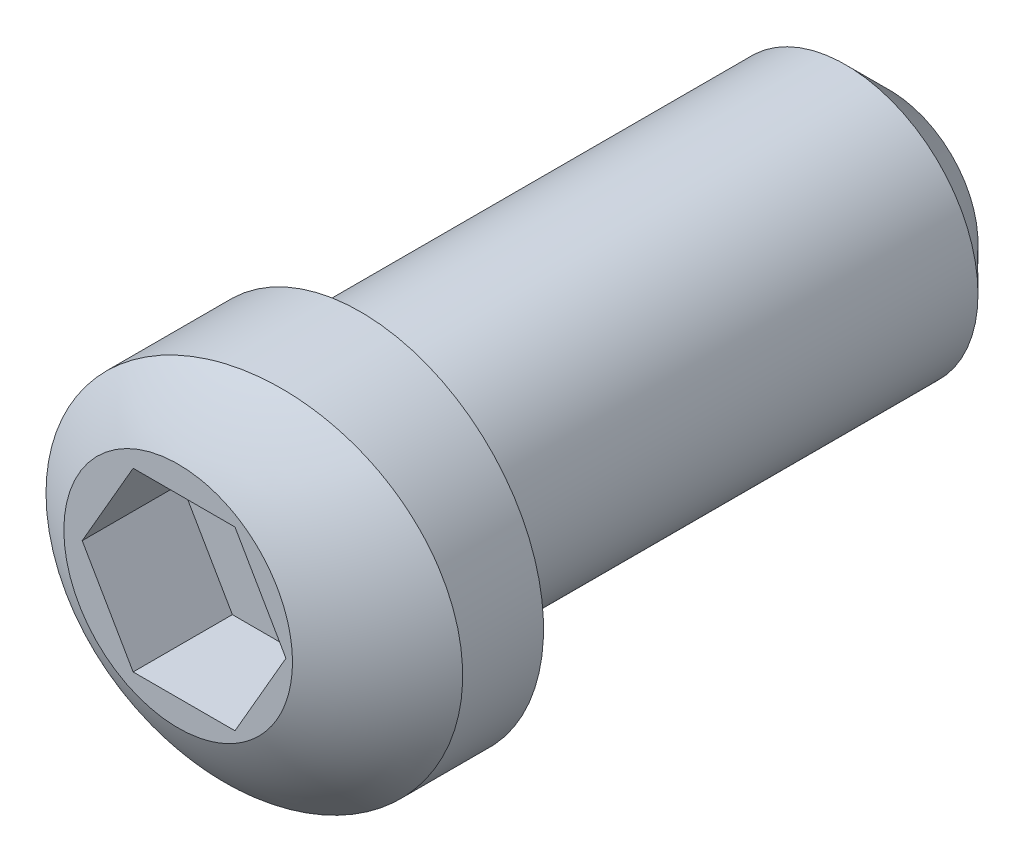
ISO-10303-21;
HEADER;
FILE_DESCRIPTION(('STEP AP214'),'2;1');
FILE_NAME('part.step','',(''),(''),'','','');
FILE_SCHEMA(('AUTOMOTIVE_DESIGN { 1 0 10303 214 1 1 1 1 }'));
ENDSEC;
DATA;
#1=APPLICATION_CONTEXT('core data for automotive mechanical design processes');
#2=APPLICATION_PROTOCOL_DEFINITION('international standard','automotive_design',2000,#1);
#3=PRODUCT_CONTEXT('',#1,'mechanical');
#4=PRODUCT('Part','Part','',(#3));
#5=PRODUCT_RELATED_PRODUCT_CATEGORY('part','',(#4));
#6=PRODUCT_DEFINITION_FORMATION('','',#4);
#7=PRODUCT_DEFINITION_CONTEXT('part definition',#1,'design');
#8=PRODUCT_DEFINITION('design','',#6,#7);
#9=PRODUCT_DEFINITION_SHAPE('','',#8);
#10=(LENGTH_UNIT() NAMED_UNIT(*) SI_UNIT(.MILLI.,.METRE.));
#11=(NAMED_UNIT(*) PLANE_ANGLE_UNIT() SI_UNIT($,.RADIAN.));
#12=(NAMED_UNIT(*) SI_UNIT($,.STERADIAN.) SOLID_ANGLE_UNIT());
#13=UNCERTAINTY_MEASURE_WITH_UNIT(LENGTH_MEASURE(1.E-05),#10,'distance_accuracy_value','');
#14=(GEOMETRIC_REPRESENTATION_CONTEXT(3) GLOBAL_UNCERTAINTY_ASSIGNED_CONTEXT((#13)) GLOBAL_UNIT_ASSIGNED_CONTEXT((#10,
#11,#12)) REPRESENTATION_CONTEXT('',''));
#15=CARTESIAN_POINT('',(0.,0.,0.));
#16=DIRECTION('',(0.,0.,1.));
#17=DIRECTION('',(1.,0.,0.));
#18=AXIS2_PLACEMENT_3D('',#15,#16,#17);
#19=CARTESIAN_POINT('',(9.9709752,8.97097519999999,4.11212093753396E-09));
#20=DIRECTION('',(-2.84865179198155E-10,-1.417613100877E-10,1.));
#21=DIRECTION('',(-1.,0.,-2.84865179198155E-10));
#22=AXIS2_PLACEMENT_3D('',#19,#20,#21);
#23=PLANE('',#22);
#24=CARTESIAN_POINT('',(0.,0.,0.));
#25=DIRECTION('',(-2.84865179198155E-10,-1.417613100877E-10,1.));
#26=DIRECTION('',(1.,0.,2.84865179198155E-10));
#27=AXIS2_PLACEMENT_3D('',#24,#25,#26);
#28=CIRCLE('',#27,6.);
#29=CARTESIAN_POINT('',(6.,0.,1.70919164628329E-09));
#30=VERTEX_POINT('',#29);
#31=EDGE_CURVE('E127',#30,#30,#28,.F.);
#32=ORIENTED_EDGE('',*,*,#31,.F.);
#33=EDGE_LOOP('',(#32));
#34=FACE_BOUND('',#33,.T.);
#35=CARTESIAN_POINT('',(1.,0.,2.84865179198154E-10));
#36=DIRECTION('',(2.84865179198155E-10,1.417613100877E-10,-1.));
#37=DIRECTION('',(-1.,0.,-2.84865179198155E-10));
#38=AXIS2_PLACEMENT_3D('',#35,#36,#37);
#39=CIRCLE('',#38,8.3);
#40=CARTESIAN_POINT('',(-7.3,0.,-2.07951580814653E-09));
#41=VERTEX_POINT('',#40);
#42=EDGE_CURVE('E123',#41,#41,#39,.T.);
#43=ORIENTED_EDGE('',*,*,#42,.T.);
#44=EDGE_LOOP('',(#43));
#45=FACE_BOUND('',#44,.T.);
#46=ADVANCED_FACE('F14',(#34,#45),#23,.F.);
#47=CARTESIAN_POINT('',(7.12162945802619E-09,3.54403275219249E-09,-25.));
#48=DIRECTION('',(-2.84865179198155E-10,-1.417613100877E-10,1.));
#49=DIRECTION('',(1.,0.,2.84865179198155E-10));
#50=AXIS2_PLACEMENT_3D('',#47,#48,#49);
#51=CYLINDRICAL_SURFACE('',#50,6.);
#52=CARTESIAN_POINT('',(6.5518991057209E-09,3.26051013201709E-09,-23.));
#53=DIRECTION('',(2.84865176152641E-10,1.417613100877E-10,-1.));
#54=DIRECTION('',(-1.,0.,-2.84865176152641E-10));
#55=AXIS2_PLACEMENT_3D('',#52,#53,#54);
#56=CIRCLE('',#55,6.);
#57=CARTESIAN_POINT('',(-5.9999999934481,3.26051013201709E-09,-23.0000000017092));
#58=VERTEX_POINT('',#57);
#59=EDGE_CURVE('E9',#58,#58,#56,.F.);
#60=ORIENTED_EDGE('',*,*,#59,.T.);
#61=EDGE_LOOP('',(#60));
#62=FACE_BOUND('',#61,.T.);
#63=ORIENTED_EDGE('',*,*,#31,.T.);
#64=EDGE_LOOP('',(#63));
#65=FACE_BOUND('',#64,.T.);
#66=ADVANCED_FACE('F173',(#62,#65),#51,.T.);
#67=CARTESIAN_POINT('',(7.12162945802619E-09,3.54403275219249E-09,-25.));
#68=DIRECTION('',(2.84865179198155E-10,1.417613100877E-10,-1.));
#69=DIRECTION('',(-1.,0.,-2.84865179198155E-10));
#70=AXIS2_PLACEMENT_3D('',#67,#68,#69);
#71=PLANE('',#70);
#72=CARTESIAN_POINT('',(7.12162945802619E-09,3.54403275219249E-09,-25.));
#73=DIRECTION('',(2.84865179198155E-10,1.417613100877E-10,-1.));
#74=DIRECTION('',(-1.,0.,-2.84865179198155E-10));
#75=AXIS2_PLACEMENT_3D('',#72,#73,#74);
#76=CIRCLE('',#75,4.);
#77=CARTESIAN_POINT('',(-3.99999999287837,3.54403275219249E-09,-25.0000000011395));
#78=VERTEX_POINT('',#77);
#79=EDGE_CURVE('E23',#78,#78,#76,.T.);
#80=ORIENTED_EDGE('',*,*,#79,.T.);
#81=EDGE_LOOP('',(#80));
#82=FACE_BOUND('',#81,.T.);
#83=ADVANCED_FACE('F179',(#82),#71,.T.);
#84=CARTESIAN_POINT('',(7.12162945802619E-09,3.54403275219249E-09,-25.));
#85=DIRECTION('',(-2.84865176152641E-10,-1.417613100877E-10,1.));
#86=DIRECTION('',(1.,0.,2.84865176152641E-10));
#87=AXIS2_PLACEMENT_3D('',#84,#85,#86);
#88=CONICAL_SURFACE('',#87,4.,0.785398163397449);
#89=ORIENTED_EDGE('',*,*,#59,.F.);
#90=EDGE_LOOP('',(#89));
#91=FACE_BOUND('',#90,.T.);
#92=ORIENTED_EDGE('',*,*,#79,.F.);
#93=EDGE_LOOP('',(#92));
#94=FACE_BOUND('',#93,.T.);
#95=ADVANCED_FACE('F16',(#91,#94),#88,.T.);
#96=CARTESIAN_POINT('',(0.999999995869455,-2.05554482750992E-09,14.5000000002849));
#97=DIRECTION('',(2.84865179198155E-10,1.417613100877E-10,-1.));
#98=DIRECTION('',(-1.,0.,-2.84865179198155E-10));
#99=AXIS2_PLACEMENT_3D('',#96,#97,#98);
#100=CYLINDRICAL_SURFACE('',#99,8.3);
#101=CARTESIAN_POINT('',(-4.85601968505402,-5.88192430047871,5.65586050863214));
#102=CARTESIAN_POINT('',(-4.68985714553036,-6.04735699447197,5.63482312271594));
#103=CARTESIAN_POINT('',(-4.51675649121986,-6.20566661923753,5.61284115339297));
#104=CARTESIAN_POINT('',(-4.15786344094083,-6.50702347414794,5.56710225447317));
#105=CARTESIAN_POINT('',(-3.9720674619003,-6.65006636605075,5.54334482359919));
#106=CARTESIAN_POINT('',(-3.58897571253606,-6.91999087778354,5.49417058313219));
#107=CARTESIAN_POINT('',(-3.39166705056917,-7.04685385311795,5.46875190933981));
#108=CARTESIAN_POINT('',(-2.9871702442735,-7.28336197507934,5.41642718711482));
#109=CARTESIAN_POINT('',(-2.77998192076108,-7.39300680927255,5.38952111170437));
#110=CARTESIAN_POINT('',(-2.35739994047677,-7.594247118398,5.33440423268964));
#111=CARTESIAN_POINT('',(-2.14201323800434,-7.6858575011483,5.30619453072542));
#112=CARTESIAN_POINT('',(-1.70440916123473,-7.8505302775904,5.24861842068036));
#113=CARTESIAN_POINT('',(-1.48219167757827,-7.92359237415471,5.2192519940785));
#114=CARTESIAN_POINT('',(-1.03260633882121,-8.0506556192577,5.15955519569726));
#115=CARTESIAN_POINT('',(-0.805240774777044,-8.10466507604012,5.12922525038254));
#116=CARTESIAN_POINT('',(-0.346790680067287,-8.19333166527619,5.06776731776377));
#117=CARTESIAN_POINT('',(-0.115704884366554,-8.2279820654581,5.0366390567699));
#118=CARTESIAN_POINT('',(0.349714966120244,-8.27781331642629,4.97362630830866));
#119=CARTESIAN_POINT('',(0.584059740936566,-8.29289011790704,4.94173868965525));
#120=CARTESIAN_POINT('',(1.05313522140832,-8.30314472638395,4.87757740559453));
#121=CARTESIAN_POINT('',(1.28786593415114,-8.29832216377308,4.84530373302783));
#122=CARTESIAN_POINT('',(1.75606496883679,-8.2688202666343,4.78058824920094));
#123=CARTESIAN_POINT('',(1.98953322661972,-8.24413993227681,4.74814642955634));
#124=CARTESIAN_POINT('',(2.45355502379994,-8.17509634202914,4.6833224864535));
#125=CARTESIAN_POINT('',(2.68410849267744,-8.13073261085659,4.6509403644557));
#126=CARTESIAN_POINT('',(3.14151986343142,-8.02242709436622,4.58635051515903));
#127=CARTESIAN_POINT('',(3.36836081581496,-7.95841305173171,4.55414388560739));
#128=CARTESIAN_POINT('',(3.81594329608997,-7.81127276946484,4.49025648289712));
#129=CARTESIAN_POINT('',(4.03668217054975,-7.72813835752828,4.45857594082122));
#130=CARTESIAN_POINT('',(4.47038193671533,-7.54334214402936,4.39600260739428));
#131=CARTESIAN_POINT('',(4.68334277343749,-7.44168021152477,4.36510982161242));
#132=CARTESIAN_POINT('',(5.09986252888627,-7.22057456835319,4.3043766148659));
#133=CARTESIAN_POINT('',(5.30342546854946,-7.1011385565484,4.27453574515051));
#134=CARTESIAN_POINT('',(5.69944342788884,-6.84548654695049,4.21619311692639));
#135=CARTESIAN_POINT('',(5.89191634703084,-6.70929876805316,4.18768921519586));
#136=CARTESIAN_POINT('',(6.26471350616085,-6.42092857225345,4.13221810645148));
#137=CARTESIAN_POINT('',(6.44503802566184,-6.26874652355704,4.10525086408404));
#138=CARTESIAN_POINT('',(6.79221464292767,-5.94944288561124,4.05309843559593));
#139=CARTESIAN_POINT('',(6.95906682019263,-5.78232138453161,4.02791323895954));
#140=CARTESIAN_POINT('',(7.2780535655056,-5.43431289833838,3.97956405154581));
#141=CARTESIAN_POINT('',(7.43018852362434,-5.25342627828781,3.95640000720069));
#142=CARTESIAN_POINT('',(7.71745258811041,-4.88065170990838,3.91249553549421));
#143=CARTESIAN_POINT('',(7.85270712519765,-4.68886251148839,3.89173732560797));
#144=CARTESIAN_POINT('',(8.10654531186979,-4.29441480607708,3.85264910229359));
#145=CARTESIAN_POINT('',(8.22513499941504,-4.09176027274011,3.83431820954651));
#146=CARTESIAN_POINT('',(8.44481382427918,-3.67693340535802,3.80026346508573));
#147=CARTESIAN_POINT('',(8.54590069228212,-3.46475984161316,3.78453995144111));
#148=CARTESIAN_POINT('',(8.7297767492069,-3.03244560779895,3.75587059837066));
#149=CARTESIAN_POINT('',(8.81256608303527,-2.81230500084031,3.74292473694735));
#150=CARTESIAN_POINT('',(8.95838314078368,-2.36815515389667,3.72008069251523));
#151=CARTESIAN_POINT('',(9.02162158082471,-2.14421674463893,3.71015003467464));
#152=CARTESIAN_POINT('',(9.1290941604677,-1.69171612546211,3.69325113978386));
#153=CARTESIAN_POINT('',(9.17332847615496,-1.46315395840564,3.68628287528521));
#154=CARTESIAN_POINT('',(9.24244994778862,-1.00306149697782,3.67538612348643));
#155=CARTESIAN_POINT('',(9.26733798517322,-0.771531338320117,3.67145749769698));
#156=CARTESIAN_POINT('',(9.29757703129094,-0.30716715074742,3.66668345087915));
#157=CARTESIAN_POINT('',(9.30292811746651,-0.0743331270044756,3.66583801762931));
#158=CARTESIAN_POINT('',(9.29408876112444,0.389030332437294,3.66723398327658));
#159=CARTESIAN_POINT('',(9.28005920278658,0.619562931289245,3.66944996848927));
#160=CARTESIAN_POINT('',(9.23284303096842,1.07868903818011,3.67690051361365));
#161=CARTESIAN_POINT('',(9.19964983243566,1.30728185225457,3.68213611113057));
#162=CARTESIAN_POINT('',(9.114362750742,1.76077834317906,3.69556794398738));
#163=CARTESIAN_POINT('',(9.06227256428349,1.98568273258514,3.70376360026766));
#164=CARTESIAN_POINT('',(8.93958419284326,2.43026340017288,3.72302712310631));
#165=CARTESIAN_POINT('',(8.86898563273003,2.64993957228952,3.73409504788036));
#166=CARTESIAN_POINT('',(8.70980059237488,3.08254851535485,3.75898697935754));
#167=CARTESIAN_POINT('',(8.6212115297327,3.29548031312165,3.77281138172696));
#168=CARTESIAN_POINT('',(8.4267099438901,3.71309010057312,3.80307154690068));
#169=CARTESIAN_POINT('',(8.32079705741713,3.91776791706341,3.81950736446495));
#170=CARTESIAN_POINT('',(8.09244773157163,4.3174233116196,3.85482055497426));
#171=CARTESIAN_POINT('',(7.97001388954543,4.51240240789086,3.8736975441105));
#172=CARTESIAN_POINT('',(7.70945640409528,4.89143151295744,3.91371607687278));
#173=CARTESIAN_POINT('',(7.5713273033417,5.07547768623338,3.93485840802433));
#174=CARTESIAN_POINT('',(7.27926416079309,5.4327239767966,3.97937491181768));
#175=CARTESIAN_POINT('',(7.12521451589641,5.60582756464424,4.00276530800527));
#176=CARTESIAN_POINT('',(6.80327578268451,5.93848355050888,4.05142631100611));
#177=CARTESIAN_POINT('',(6.63538160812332,6.09803092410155,4.07669760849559));
#178=CARTESIAN_POINT('',(6.28702737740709,6.40240834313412,4.12888116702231));
#179=CARTESIAN_POINT('',(6.10656918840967,6.54724056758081,4.15579318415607));
#180=CARTESIAN_POINT('',(5.73433479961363,6.82125256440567,4.21102875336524));
#181=CARTESIAN_POINT('',(5.54255830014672,6.95043192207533,4.23935234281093));
#182=CARTESIAN_POINT('',(5.14685061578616,7.19361909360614,4.29749464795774));
#183=CARTESIAN_POINT('',(4.94280835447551,7.30744307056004,4.32732644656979));
#184=CARTESIAN_POINT('',(4.52596796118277,7.51744749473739,4.38794702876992));
#185=CARTESIAN_POINT('',(4.31316956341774,7.61362740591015,4.41873584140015));
#186=CARTESIAN_POINT('',(3.88034849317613,7.78768208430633,4.4810225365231));
#187=CARTESIAN_POINT('',(3.66032679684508,7.86555931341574,4.51252032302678));
#188=CARTESIAN_POINT('',(3.21449944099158,8.00252403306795,4.57599990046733));
#189=CARTESIAN_POINT('',(2.98869191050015,8.06160536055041,4.60798184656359));
#190=CARTESIAN_POINT('',(2.53112542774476,8.1609372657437,4.67244037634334));
#191=CARTESIAN_POINT('',(2.29933344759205,8.20103452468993,4.7049188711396));
#192=CARTESIAN_POINT('',(1.83318436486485,8.2614187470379,4.76988516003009));
#193=CARTESIAN_POINT('',(1.59882725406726,8.28170564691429,4.80237295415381));
#194=CARTESIAN_POINT('',(1.12916347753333,8.30232370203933,4.86713719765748));
#195=CARTESIAN_POINT('',(0.893856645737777,8.30265120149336,4.89941360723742));
#196=CARTESIAN_POINT('',(0.424081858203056,8.28333059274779,4.96351993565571));
#197=CARTESIAN_POINT('',(0.189613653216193,8.26368901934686,4.99534999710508));
#198=CARTESIAN_POINT('',(-0.277401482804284,8.20449673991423,5.05843318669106));
#199=CARTESIAN_POINT('',(-0.509943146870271,8.16490296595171,5.08968491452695));
#200=CARTESIAN_POINT('',(-0.970917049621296,8.06604316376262,5.15133794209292));
#201=CARTESIAN_POINT('',(-1.19934937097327,8.00677753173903,5.1817392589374));
#202=CARTESIAN_POINT('',(-1.65046664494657,7.8689676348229,5.24150061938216));
#203=CARTESIAN_POINT('',(-1.87315152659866,7.7904231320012,5.27086065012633));
#204=CARTESIAN_POINT('',(-2.31115214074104,7.61458865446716,5.32835668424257));
#205=CARTESIAN_POINT('',(-2.52646804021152,7.51729910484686,5.35649271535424));
#206=CARTESIAN_POINT('',(-2.94738280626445,7.30503385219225,5.41126849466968));
#207=CARTESIAN_POINT('',(-3.15301471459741,7.19012500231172,5.43791339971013));
#208=CARTESIAN_POINT('',(-3.55383812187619,6.94319427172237,5.48965123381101));
#209=CARTESIAN_POINT('',(-3.74903331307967,6.81117850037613,5.51474471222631));
#210=CARTESIAN_POINT('',(-4.12765935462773,6.53089562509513,5.56324659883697));
#211=CARTESIAN_POINT('',(-4.31108826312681,6.38262584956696,5.58665472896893));
#212=CARTESIAN_POINT('',(-4.66478430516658,6.07089659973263,5.63164472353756));
#213=CARTESIAN_POINT('',(-4.83505180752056,5.90743755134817,5.65322663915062));
#214=CARTESIAN_POINT('',(-5.15996196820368,5.56773772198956,5.69428905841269));
#215=CARTESIAN_POINT('',(-5.31471020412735,5.39159964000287,5.7137838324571));
#216=CARTESIAN_POINT('',(-5.608843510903,5.02673801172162,5.75074175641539));
#217=CARTESIAN_POINT('',(-5.74822895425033,4.83801477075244,5.76820495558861));
#218=CARTESIAN_POINT('',(-6.01062243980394,4.44928884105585,5.80100491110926));
#219=CARTESIAN_POINT('',(-6.13362793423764,4.24928440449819,5.81634133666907));
#220=CARTESIAN_POINT('',(-6.3622731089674,3.83952595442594,5.84479392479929));
#221=CARTESIAN_POINT('',(-6.46791896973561,3.62977544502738,5.85791087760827));
#222=CARTESIAN_POINT('',(-6.66037484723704,3.2035787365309,5.88176816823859));
#223=CARTESIAN_POINT('',(-6.74732054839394,2.98719475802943,5.89252563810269));
#224=CARTESIAN_POINT('',(-6.90272455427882,2.54779289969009,5.91172945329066));
#225=CARTESIAN_POINT('',(-6.97118336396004,2.32477520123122,5.92017586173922));
#226=CARTESIAN_POINT('',(-7.089101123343,1.87370812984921,5.93471156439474));
#227=CARTESIAN_POINT('',(-7.13856097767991,1.64565899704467,5.94080097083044));
#228=CARTESIAN_POINT('',(-7.21811341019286,1.18616074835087,5.9505900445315));
#229=CARTESIAN_POINT('',(-7.24820637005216,0.954711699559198,5.95428975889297));
#230=CARTESIAN_POINT('',(-7.2886926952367,0.491307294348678,5.95926632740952));
#231=CARTESIAN_POINT('',(-7.2991895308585,0.259361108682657,5.96055590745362));
#232=CARTESIAN_POINT('',(-7.30071986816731,-0.204515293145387,5.96074394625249));
#233=CARTESIAN_POINT('',(-7.29176019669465,-0.43644548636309,5.95964324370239));
#234=CARTESIAN_POINT('',(-7.25445022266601,-0.898815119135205,5.95505736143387));
#235=CARTESIAN_POINT('',(-7.22609177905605,-1.129253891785,5.95157118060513));
#236=CARTESIAN_POINT('',(-7.15018759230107,-1.58689670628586,5.94223212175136));
#237=CARTESIAN_POINT('',(-7.10264215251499,-1.81410079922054,5.93637928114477));
#238=CARTESIAN_POINT('',(-6.98876521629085,-2.26347311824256,5.92234429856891));
#239=CARTESIAN_POINT('',(-6.92244960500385,-2.4856454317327,5.91416412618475));
#240=CARTESIAN_POINT('',(-6.77150796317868,-2.923577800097,5.89551666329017));
#241=CARTESIAN_POINT('',(-6.686882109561,-3.13933791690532,5.88504939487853));
#242=CARTESIAN_POINT('',(-6.50004090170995,-3.56270428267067,5.86189620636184));
#243=CARTESIAN_POINT('',(-6.39784454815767,-3.77031904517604,5.84921268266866));
#244=CARTESIAN_POINT('',(-6.17658777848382,-4.17612182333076,5.82169266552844));
#245=CARTESIAN_POINT('',(-6.05753183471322,-4.37431232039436,5.8068567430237));
#246=CARTESIAN_POINT('',(-5.77434153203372,-4.80403444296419,5.771479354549));
#247=CARTESIAN_POINT('',(-5.60612156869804,-5.03284493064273,5.75040863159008));
#248=CARTESIAN_POINT('',(-5.24731527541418,-5.47187598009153,5.70530483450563));
#249=CARTESIAN_POINT('',(-5.05672899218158,-5.68209658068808,5.68127176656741));
#250=CARTESIAN_POINT('',(-4.85601968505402,-5.88192430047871,5.65586050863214));
#251=B_SPLINE_CURVE_WITH_KNOTS('',3,(#101,#102,#103,#104,#105,#106,#107,#108,#109,#110,#111,
#112,#113,#114,#115,#116,#117,#118,#119,#120,#121,#122,#123,#124,#125,#126,#127,#128,#129,#130,
#131,#132,#133,#134,#135,#136,#137,#138,#139,#140,#141,#142,#143,#144,#145,#146,#147,#148,#149,
#150,#151,#152,#153,#154,#155,#156,#157,#158,#159,#160,#161,#162,#163,#164,#165,#166,#167,#168,
#169,#170,#171,#172,#173,#174,#175,#176,#177,#178,#179,#180,#181,#182,#183,#184,#185,#186,#187,
#188,#189,#190,#191,#192,#193,#194,#195,#196,#197,#198,#199,#200,#201,#202,#203,#204,#205,#206,
#207,#208,#209,#210,#211,#212,#213,#214,#215,#216,#217,#218,#219,#220,#221,#222,#223,#224,#225,
#226,#227,#228,#229,#230,#231,#232,#233,#234,#235,#236,#237,#238,#239,#240,#241,#242,#243,#244,
#245,#246,#247,#248,#249,#250),.UNSPECIFIED.,.T.,.F.,(4,2,2,2,2,2,2,2,2,2,2,2,2,2,2,2,2,2,2,2,2,
2,2,2,2,2,2,2,2,2,2,2,2,2,2,2,2,2,2,2,2,2,2,2,2,2,2,2,2,2,2,2,2,2,2,2,2,2,2,2,2,2,2,2,2,2,2,2,2,
2,2,2,2,2,4),(0.,0.705995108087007,1.4121903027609,2.11919204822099,2.82620662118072,
3.53263427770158,4.23907324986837,4.94520378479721,5.65157972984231,6.36169545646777,
7.07182437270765,7.78198904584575,8.49217086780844,9.20499607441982,9.91812652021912,
10.6312620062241,11.3440894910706,12.0557322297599,12.7673585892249,13.4789807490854,
14.1905840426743,14.8965374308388,15.6022343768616,16.3080227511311,17.0138055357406,
17.7116925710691,18.4095731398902,19.1074219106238,19.8052679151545,20.4973555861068,
21.1896812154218,21.8818714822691,22.5740757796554,23.2663795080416,23.9586977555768,
24.6509072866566,25.3433582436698,26.0412472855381,26.7393938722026,27.437436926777,
28.1354984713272,28.8412897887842,29.5471025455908,30.2528203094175,30.9587692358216,
31.6703261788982,32.3818854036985,33.0935749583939,33.8050316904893,34.5180307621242,
35.2310154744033,35.9440089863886,36.6569863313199,37.3673224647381,38.0774056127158,
38.7876056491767,39.4977857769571,40.2027496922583,40.9076965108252,41.6127528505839,
42.3175576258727,43.017061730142,43.7165467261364,44.4159984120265,45.1154363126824,
45.8111705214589,46.5066606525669,47.2024428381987,47.8982140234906,48.5933981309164,
49.2885755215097,49.983005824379,50.6772522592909,51.5300322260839,52.3828104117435),.UNSPECIFIED.);
#252=CARTESIAN_POINT('',(-7.30000000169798,0.,5.96065549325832));
#253=VERTEX_POINT('',#252);
#254=EDGE_CURVE('E126',#253,#253,#251,.T.);
#255=ORIENTED_EDGE('',*,*,#254,.F.);
#256=EDGE_LOOP('',(#255));
#257=FACE_BOUND('',#256,.T.);
#258=ORIENTED_EDGE('',*,*,#42,.F.);
#259=EDGE_LOOP('',(#258));
#260=FACE_BOUND('',#259,.T.);
#261=ADVANCED_FACE('F140',(#257,#260),#100,.T.);
#262=CARTESIAN_POINT('',(-0.269999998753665,0.,-4.3751608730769));
#263=DIRECTION('',(-0.147750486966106,0.,-0.989024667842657));
#264=DIRECTION('',(-0.989024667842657,0.,0.147750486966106));
#265=AXIS2_PLACEMENT_3D('',#262,#263,#264);
#266=SPHERICAL_SURFACE('',#265,12.5);
#267=CARTESIAN_POINT('',(-0.269999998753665,0.,7.00000000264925));
#268=DIRECTION('',(0.,0.,-1.));
#269=DIRECTION('',(-1.,0.,0.));
#270=AXIS2_PLACEMENT_3D('',#267,#268,#269);
#271=CIRCLE('',#270,5.18224999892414);
#272=CARTESIAN_POINT('',(-5.45224999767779,0.,7.00000000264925));
#273=VERTEX_POINT('',#272);
#274=EDGE_CURVE('E18',#273,#273,#271,.F.);
#275=CARTESIAN_POINT('',(-5.45224999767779,0.,7.00000000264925));
#276=CARTESIAN_POINT('',(-5.47237031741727,0.,6.99083366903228));
#277=CARTESIAN_POINT('',(-5.49246631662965,0.,6.98161395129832));
#278=CARTESIAN_POINT('',(-5.53260910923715,0.,6.96306800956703));
#279=CARTESIAN_POINT('',(-5.55265590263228,0.,6.9537417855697));
#280=CARTESIAN_POINT('',(-5.59269971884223,0.,6.93498309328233));
#281=CARTESIAN_POINT('',(-5.61269674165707,0.,6.92555062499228));
#282=CARTESIAN_POINT('',(-5.65264045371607,0.,6.90657970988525));
#283=CARTESIAN_POINT('',(-5.67258714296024,0.,6.89704126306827));
#284=CARTESIAN_POINT('',(-5.71242962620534,0.,6.87785865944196));
#285=CARTESIAN_POINT('',(-5.73232542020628,0.,6.86821450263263));
#286=CARTESIAN_POINT('',(-5.77206555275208,0.,6.84882075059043));
#287=CARTESIAN_POINT('',(-5.79190989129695,0.,6.83907115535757));
#288=CARTESIAN_POINT('',(-5.83154655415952,0.,6.81946680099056));
#289=CARTESIAN_POINT('',(-5.85133887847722,0.,6.80961204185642));
#290=CARTESIAN_POINT('',(-5.89087095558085,0.,6.78979763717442));
#291=CARTESIAN_POINT('',(-5.91061070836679,0.,6.77983799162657));
#292=CARTESIAN_POINT('',(-5.95003708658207,0.,6.75981409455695));
#293=CARTESIAN_POINT('',(-5.96972371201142,0.,6.74974984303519));
#294=CARTESIAN_POINT('',(-6.00904328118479,0.,6.72951701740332));
#295=CARTESIAN_POINT('',(-6.02867622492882,0.,6.71934844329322));
#296=CARTESIAN_POINT('',(-6.06788787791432,0.,6.69890725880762));
#297=CARTESIAN_POINT('',(-6.08746658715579,0.,6.68863464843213));
#298=CARTESIAN_POINT('',(-6.12656921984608,0.,6.66798568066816));
#299=CARTESIAN_POINT('',(-6.14609314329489,0.,6.65760932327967));
#300=CARTESIAN_POINT('',(-6.1850856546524,0.,6.63675315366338));
#301=CARTESIAN_POINT('',(-6.2045542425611,0.,6.62627334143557));
#302=CARTESIAN_POINT('',(-6.24343553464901,0.,6.60521055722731));
#303=CARTESIAN_POINT('',(-6.26284823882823,0.,6.59462758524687));
#304=CARTESIAN_POINT('',(-6.30161721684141,0.,6.57335877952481));
#305=CARTESIAN_POINT('',(-6.32097349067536,0.,6.56267294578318));
#306=CARTESIAN_POINT('',(-6.35962906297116,0.,6.54119871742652));
#307=CARTESIAN_POINT('',(-6.37892836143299,0.,6.53041032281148));
#308=CARTESIAN_POINT('',(-6.41746943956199,0.,6.50873127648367));
#309=CARTESIAN_POINT('',(-6.43671121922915,0.,6.49784062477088));
#310=CARTESIAN_POINT('',(-6.47513671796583,0.,6.47595737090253));
#311=CARTESIAN_POINT('',(-6.49432043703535,0.,6.46496476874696));
#312=CARTESIAN_POINT('',(-6.53262927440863,0.,6.44287792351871));
#313=CARTESIAN_POINT('',(-6.55175439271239,0.,6.43178368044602));
#314=CARTESIAN_POINT('',(-6.58994549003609,0.,6.40949386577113));
#315=CARTESIAN_POINT('',(-6.60901146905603,0.,6.39829829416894));
#316=CARTESIAN_POINT('',(-6.64708375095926,0.,6.37580613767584));
#317=CARTESIAN_POINT('',(-6.66609005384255,0.,6.36450955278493));
#318=CARTESIAN_POINT('',(-6.70404244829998,0.,6.34181568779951));
#319=CARTESIAN_POINT('',(-6.72298853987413,0.,6.33041840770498));
#320=CARTESIAN_POINT('',(-6.76081997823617,0.,6.30752347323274));
#321=CARTESIAN_POINT('',(-6.77970532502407,0.,6.29602581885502));
#322=CARTESIAN_POINT('',(-6.81741474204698,0.,6.27293045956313));
#323=CARTESIAN_POINT('',(-6.83623881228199,0.,6.26133275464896));
#324=CARTESIAN_POINT('',(-6.87382514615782,0.,6.23803762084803));
#325=CARTESIAN_POINT('',(-6.89258740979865,0.,6.22634019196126));
#326=CARTESIAN_POINT('',(-6.93004960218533,0.,6.20284593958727));
#327=CARTESIAN_POINT('',(-6.94874953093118,0.,6.19104911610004));
#328=CARTESIAN_POINT('',(-6.98608652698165,0.,6.16735640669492));
#329=CARTESIAN_POINT('',(-7.00472359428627,0.,6.15546052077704));
#330=CARTESIAN_POINT('',(-7.04193434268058,0.,6.1315700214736));
#331=CARTESIAN_POINT('',(-7.06050802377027,0.,6.11957540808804));
#332=CARTESIAN_POINT('',(-7.09759147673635,0.,6.09548779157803));
#333=CARTESIAN_POINT('',(-7.11610124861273,0.,6.08339478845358));
#334=CARTESIAN_POINT('',(-7.1530563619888,0.,6.0591107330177));
#335=CARTESIAN_POINT('',(-7.17150170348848,0.,6.04691968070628));
#336=CARTESIAN_POINT('',(-7.20832743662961,0.,6.02243987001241));
#337=CARTESIAN_POINT('',(-7.22670782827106,0.,6.01015111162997));
#338=CARTESIAN_POINT('',(-7.26340314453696,0.,5.98547623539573));
#339=CARTESIAN_POINT('',(-7.28171806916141,0.,5.97309011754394));
#340=CARTESIAN_POINT('',(-7.30000000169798,0.,5.96065549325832));
#341=B_SPLINE_CURVE_WITH_KNOTS('',3,(#275,#276,#277,#278,#279,#280,#281,#282,#283,#284,#285,
#286,#287,#288,#289,#290,#291,#292,#293,#294,#295,#296,#297,#298,#299,#300,#301,#302,#303,#304,
#305,#306,#307,#308,#309,#310,#311,#312,#313,#314,#315,#316,#317,#318,#319,#320,#321,#322,#323,
#324,#325,#326,#327,#328,#329,#330,#331,#332,#333,#334,#335,#336,#337,#338,#339,#340),
.UNSPECIFIED.,.F.,.F.,(4,2,2,2,2,2,2,2,2,2,2,2,2,2,2,2,2,2,2,2,2,2,2,2,2,2,2,2,2,2,2,2,4),(0.,
0.0663297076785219,0.132659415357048,0.19898912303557,0.265318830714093,0.331648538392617,
0.397978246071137,0.464307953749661,0.530637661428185,0.596967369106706,0.663297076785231,
0.729626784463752,0.795956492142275,0.862286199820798,0.928615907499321,0.994945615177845,
1.06127532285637,1.12760503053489,1.19393473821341,1.26026444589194,1.32659415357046,
1.39292386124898,1.45925356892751,1.52558327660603,1.59191298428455,1.65824269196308,
1.7245723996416,1.79090210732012,1.85723181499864,1.92356152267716,1.98989123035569,
2.05622093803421,2.12255064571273),.UNSPECIFIED.);
#342=EDGE_CURVE('BSEAM137',#273,#253,#341,.T.);
#343=ORIENTED_EDGE('',*,*,#274,.F.);
#344=ORIENTED_EDGE('',*,*,#254,.T.);
#345=ORIENTED_EDGE('',*,*,#342,.T.);
#346=ORIENTED_EDGE('',*,*,#342,.F.);
#347=EDGE_LOOP('',(#343,#345,#344,#346));
#348=FACE_BOUND('',#347,.T.);
#349=ADVANCED_FACE('F137',(#348),#266,.T.);
#350=CARTESIAN_POINT('',(-10.1878306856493,-12.25,7.00000000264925));
#351=DIRECTION('',(0.,0.,-1.));
#352=DIRECTION('',(-1.,0.,0.));
#353=AXIS2_PLACEMENT_3D('',#350,#351,#352);
#354=PLANE('',#353);
#355=DIRECTION('',(0.5,-0.866025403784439,0.));
#356=VECTOR('',#355,1.);
#357=CARTESIAN_POINT('',(-4.61880215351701,0.,7.00000000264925));
#358=LINE('',#357,#356);
#359=CARTESIAN_POINT('',(-4.61880215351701,0.,7.00000000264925));
#360=VERTEX_POINT('',#359);
#361=CARTESIAN_POINT('',(-2.30940107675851,-4.,7.00000000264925));
#362=VERTEX_POINT('',#361);
#363=EDGE_CURVE('E105',#360,#362,#358,.T.);
#364=ORIENTED_EDGE('',*,*,#363,.F.);
#365=DIRECTION('',(-0.5,-0.866025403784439,0.));
#366=VECTOR('',#365,1.);
#367=CARTESIAN_POINT('',(-2.30940107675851,4.,7.00000000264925));
#368=LINE('',#367,#366);
#369=CARTESIAN_POINT('',(-2.30940107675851,4.,7.00000000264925));
#370=VERTEX_POINT('',#369);
#371=EDGE_CURVE('E31',#370,#360,#368,.T.);
#372=ORIENTED_EDGE('',*,*,#371,.F.);
#373=DIRECTION('',(-1.,0.,0.));
#374=VECTOR('',#373,1.);
#375=CARTESIAN_POINT('',(2.3094010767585,4.,7.00000000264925));
#376=LINE('',#375,#374);
#377=CARTESIAN_POINT('',(2.3094010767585,4.,7.00000000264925));
#378=VERTEX_POINT('',#377);
#379=EDGE_CURVE('E114',#378,#370,#376,.T.);
#380=ORIENTED_EDGE('',*,*,#379,.F.);
#381=DIRECTION('',(-0.5,0.866025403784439,0.));
#382=VECTOR('',#381,1.);
#383=CARTESIAN_POINT('',(4.61880215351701,0.,7.00000000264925));
#384=LINE('',#383,#382);
#385=CARTESIAN_POINT('',(4.61880215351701,0.,7.00000000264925));
#386=VERTEX_POINT('',#385);
#387=EDGE_CURVE('E112',#386,#378,#384,.T.);
#388=ORIENTED_EDGE('',*,*,#387,.F.);
#389=DIRECTION('',(0.5,0.866025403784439,0.));
#390=VECTOR('',#389,1.);
#391=CARTESIAN_POINT('',(2.30940107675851,-4.,7.00000000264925));
#392=LINE('',#391,#390);
#393=CARTESIAN_POINT('',(2.30940107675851,-4.,7.00000000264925));
#394=VERTEX_POINT('',#393);
#395=EDGE_CURVE('E79',#394,#386,#392,.T.);
#396=ORIENTED_EDGE('',*,*,#395,.F.);
#397=DIRECTION('',(1.,0.,0.));
#398=VECTOR('',#397,1.);
#399=CARTESIAN_POINT('',(-2.30940107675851,-4.,7.00000000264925));
#400=LINE('',#399,#398);
#401=EDGE_CURVE('E108',#362,#394,#400,.T.);
#402=ORIENTED_EDGE('',*,*,#401,.F.);
#403=EDGE_LOOP('',(#364,#372,#380,#388,#396,#402));
#404=FACE_BOUND('',#403,.T.);
#405=ORIENTED_EDGE('',*,*,#274,.T.);
#406=EDGE_LOOP('',(#405));
#407=FACE_BOUND('',#406,.T.);
#408=ADVANCED_FACE('F145',(#404,#407),#354,.F.);
#409=CARTESIAN_POINT('',(-2.30940107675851,4.,2.50000000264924));
#410=DIRECTION('',(-0.866025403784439,0.5,0.));
#411=DIRECTION('',(-0.5,-0.866025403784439,0.));
#412=AXIS2_PLACEMENT_3D('',#409,#410,#411);
#413=PLANE('',#412);
#414=ORIENTED_EDGE('',*,*,#371,.T.);
#415=DIRECTION('',(0.,0.,1.));
#416=VECTOR('',#415,1.);
#417=CARTESIAN_POINT('',(-4.61880215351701,0.,2.50000000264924));
#418=LINE('',#417,#416);
#419=CARTESIAN_POINT('',(-4.61880215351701,0.,2.50000000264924));
#420=VERTEX_POINT('',#419);
#421=EDGE_CURVE('E61',#420,#360,#418,.T.);
#422=ORIENTED_EDGE('',*,*,#421,.F.);
#423=DIRECTION('',(-0.5,-0.866025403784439,0.));
#424=VECTOR('',#423,1.);
#425=CARTESIAN_POINT('',(-2.30940107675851,4.,2.50000000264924));
#426=LINE('',#425,#424);
#427=CARTESIAN_POINT('',(-2.30940107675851,4.,2.50000000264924));
#428=VERTEX_POINT('',#427);
#429=EDGE_CURVE('E116',#428,#420,#426,.T.);
#430=ORIENTED_EDGE('',*,*,#429,.F.);
#431=DIRECTION('',(0.,0.,1.));
#432=VECTOR('',#431,1.);
#433=CARTESIAN_POINT('',(-2.30940107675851,4.,2.50000000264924));
#434=LINE('',#433,#432);
#435=EDGE_CURVE('E39',#428,#370,#434,.T.);
#436=ORIENTED_EDGE('',*,*,#435,.T.);
#437=EDGE_LOOP('',(#414,#422,#430,#436));
#438=FACE_BOUND('',#437,.T.);
#439=ADVANCED_FACE('F148',(#438),#413,.F.);
#440=CARTESIAN_POINT('',(2.3094010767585,4.,2.50000000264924));
#441=DIRECTION('',(0.,1.,0.));
#442=DIRECTION('',(0.,0.,1.));
#443=AXIS2_PLACEMENT_3D('',#440,#441,#442);
#444=PLANE('',#443);
#445=ORIENTED_EDGE('',*,*,#379,.T.);
#446=ORIENTED_EDGE('',*,*,#435,.F.);
#447=DIRECTION('',(-1.,0.,0.));
#448=VECTOR('',#447,1.);
#449=CARTESIAN_POINT('',(2.3094010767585,4.,2.50000000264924));
#450=LINE('',#449,#448);
#451=CARTESIAN_POINT('',(2.3094010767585,4.,2.50000000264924));
#452=VERTEX_POINT('',#451);
#453=EDGE_CURVE('E91',#452,#428,#450,.T.);
#454=ORIENTED_EDGE('',*,*,#453,.F.);
#455=DIRECTION('',(0.,0.,1.));
#456=VECTOR('',#455,1.);
#457=CARTESIAN_POINT('',(2.3094010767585,4.,2.50000000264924));
#458=LINE('',#457,#456);
#459=EDGE_CURVE('E83',#452,#378,#458,.T.);
#460=ORIENTED_EDGE('',*,*,#459,.T.);
#461=EDGE_LOOP('',(#445,#446,#454,#460));
#462=FACE_BOUND('',#461,.T.);
#463=ADVANCED_FACE('F152',(#462),#444,.F.);
#464=CARTESIAN_POINT('',(4.61880215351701,0.,2.50000000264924));
#465=DIRECTION('',(0.866025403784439,0.5,0.));
#466=DIRECTION('',(-0.5,0.866025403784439,0.));
#467=AXIS2_PLACEMENT_3D('',#464,#465,#466);
#468=PLANE('',#467);
#469=ORIENTED_EDGE('',*,*,#387,.T.);
#470=ORIENTED_EDGE('',*,*,#459,.F.);
#471=DIRECTION('',(-0.5,0.866025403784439,0.));
#472=VECTOR('',#471,1.);
#473=CARTESIAN_POINT('',(4.61880215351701,0.,2.50000000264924));
#474=LINE('',#473,#472);
#475=CARTESIAN_POINT('',(4.61880215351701,0.,2.50000000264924));
#476=VERTEX_POINT('',#475);
#477=EDGE_CURVE('E87',#476,#452,#474,.T.);
#478=ORIENTED_EDGE('',*,*,#477,.F.);
#479=DIRECTION('',(0.,0.,1.));
#480=VECTOR('',#479,1.);
#481=CARTESIAN_POINT('',(4.61880215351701,0.,2.50000000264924));
#482=LINE('',#481,#480);
#483=EDGE_CURVE('E72',#476,#386,#482,.T.);
#484=ORIENTED_EDGE('',*,*,#483,.T.);
#485=EDGE_LOOP('',(#469,#470,#478,#484));
#486=FACE_BOUND('',#485,.T.);
#487=ADVANCED_FACE('F88',(#486),#468,.F.);
#488=CARTESIAN_POINT('',(2.30940107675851,-4.,2.50000000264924));
#489=DIRECTION('',(0.866025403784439,-0.5,0.));
#490=DIRECTION('',(0.5,0.866025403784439,0.));
#491=AXIS2_PLACEMENT_3D('',#488,#489,#490);
#492=PLANE('',#491);
#493=ORIENTED_EDGE('',*,*,#395,.T.);
#494=ORIENTED_EDGE('',*,*,#483,.F.);
#495=DIRECTION('',(0.5,0.866025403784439,0.));
#496=VECTOR('',#495,1.);
#497=CARTESIAN_POINT('',(2.30940107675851,-4.,2.50000000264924));
#498=LINE('',#497,#496);
#499=CARTESIAN_POINT('',(2.30940107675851,-4.,2.50000000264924));
#500=VERTEX_POINT('',#499);
#501=EDGE_CURVE('E76',#500,#476,#498,.T.);
#502=ORIENTED_EDGE('',*,*,#501,.F.);
#503=DIRECTION('',(0.,0.,1.));
#504=VECTOR('',#503,1.);
#505=CARTESIAN_POINT('',(2.30940107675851,-4.,2.50000000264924));
#506=LINE('',#505,#504);
#507=EDGE_CURVE('E84',#500,#394,#506,.T.);
#508=ORIENTED_EDGE('',*,*,#507,.T.);
#509=EDGE_LOOP('',(#493,#494,#502,#508));
#510=FACE_BOUND('',#509,.T.);
#511=ADVANCED_FACE('F74',(#510),#492,.F.);
#512=CARTESIAN_POINT('',(-2.30940107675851,-4.,2.50000000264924));
#513=DIRECTION('',(0.,-1.,0.));
#514=DIRECTION('',(1.,0.,0.));
#515=AXIS2_PLACEMENT_3D('',#512,#513,#514);
#516=PLANE('',#515);
#517=ORIENTED_EDGE('',*,*,#401,.T.);
#518=ORIENTED_EDGE('',*,*,#507,.F.);
#519=DIRECTION('',(1.,0.,0.));
#520=VECTOR('',#519,1.);
#521=CARTESIAN_POINT('',(-2.30940107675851,-4.,2.50000000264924));
#522=LINE('',#521,#520);
#523=CARTESIAN_POINT('',(-2.30940107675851,-4.,2.50000000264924));
#524=VERTEX_POINT('',#523);
#525=EDGE_CURVE('E97',#524,#500,#522,.T.);
#526=ORIENTED_EDGE('',*,*,#525,.F.);
#527=DIRECTION('',(0.,0.,1.));
#528=VECTOR('',#527,1.);
#529=CARTESIAN_POINT('',(-2.30940107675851,-4.,2.50000000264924));
#530=LINE('',#529,#528);
#531=EDGE_CURVE('E120',#524,#362,#530,.T.);
#532=ORIENTED_EDGE('',*,*,#531,.T.);
#533=EDGE_LOOP('',(#517,#518,#526,#532));
#534=FACE_BOUND('',#533,.T.);
#535=ADVANCED_FACE('F156',(#534),#516,.F.);
#536=CARTESIAN_POINT('',(-4.61880215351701,0.,2.50000000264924));
#537=DIRECTION('',(-0.866025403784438,-0.5,0.));
#538=DIRECTION('',(0.5,-0.866025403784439,0.));
#539=AXIS2_PLACEMENT_3D('',#536,#537,#538);
#540=PLANE('',#539);
#541=ORIENTED_EDGE('',*,*,#363,.T.);
#542=ORIENTED_EDGE('',*,*,#531,.F.);
#543=DIRECTION('',(0.5,-0.866025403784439,0.));
#544=VECTOR('',#543,1.);
#545=CARTESIAN_POINT('',(-4.61880215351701,0.,2.50000000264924));
#546=LINE('',#545,#544);
#547=EDGE_CURVE('E99',#420,#524,#546,.T.);
#548=ORIENTED_EDGE('',*,*,#547,.F.);
#549=ORIENTED_EDGE('',*,*,#421,.T.);
#550=EDGE_LOOP('',(#541,#542,#548,#549));
#551=FACE_BOUND('',#550,.T.);
#552=ADVANCED_FACE('F153',(#551),#540,.F.);
#553=CARTESIAN_POINT('',(0.,0.,2.50000000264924));
#554=DIRECTION('',(0.,0.,1.));
#555=DIRECTION('',(1.,0.,0.));
#556=AXIS2_PLACEMENT_3D('',#553,#554,#555);
#557=PLANE('',#556);
#558=ORIENTED_EDGE('',*,*,#429,.T.);
#559=ORIENTED_EDGE('',*,*,#547,.T.);
#560=ORIENTED_EDGE('',*,*,#525,.T.);
#561=ORIENTED_EDGE('',*,*,#501,.T.);
#562=ORIENTED_EDGE('',*,*,#477,.T.);
#563=ORIENTED_EDGE('',*,*,#453,.T.);
#564=EDGE_LOOP('',(#558,#559,#560,#561,#562,#563));
#565=FACE_BOUND('',#564,.T.);
#566=ADVANCED_FACE('F94',(#565),#557,.T.);
#567=CLOSED_SHELL('',(#46,#66,#83,#95,#261,#349,#408,#439,#463,#487,#511,#535,#552,#566));
#568=MANIFOLD_SOLID_BREP('B1',#567);
#569=ADVANCED_BREP_SHAPE_REPRESENTATION('',(#18,#568),#14);
#570=SHAPE_DEFINITION_REPRESENTATION(#9,#569);
ENDSEC;
END-ISO-10303-21;
